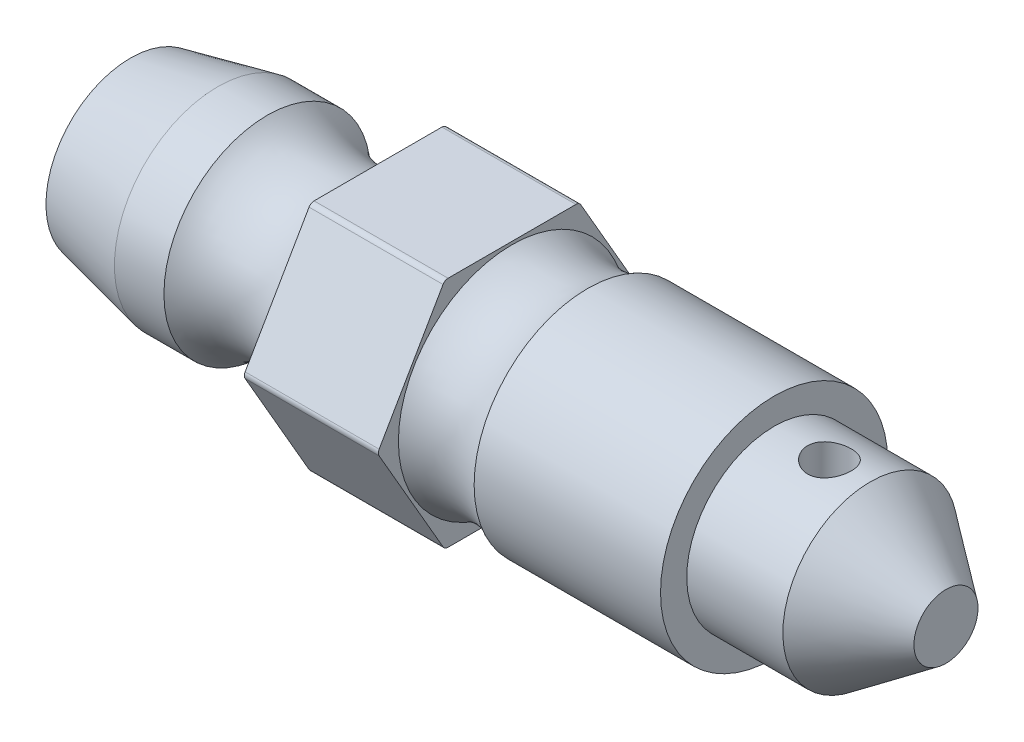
ISO-10303-21;
HEADER;
FILE_DESCRIPTION(('STEP AP214'),'2;1');
FILE_NAME('part.step','',(''),(''),'','','');
FILE_SCHEMA(('AUTOMOTIVE_DESIGN { 1 0 10303 214 1 1 1 1 }'));
ENDSEC;
DATA;
#1=APPLICATION_CONTEXT('core data for automotive mechanical design processes');
#2=APPLICATION_PROTOCOL_DEFINITION('international standard','automotive_design',2000,#1);
#3=PRODUCT_CONTEXT('',#1,'mechanical');
#4=PRODUCT('Part','Part','',(#3));
#5=PRODUCT_RELATED_PRODUCT_CATEGORY('part','',(#4));
#6=PRODUCT_DEFINITION_FORMATION('','',#4);
#7=PRODUCT_DEFINITION_CONTEXT('part definition',#1,'design');
#8=PRODUCT_DEFINITION('design','',#6,#7);
#9=PRODUCT_DEFINITION_SHAPE('','',#8);
#10=(LENGTH_UNIT() NAMED_UNIT(*) SI_UNIT(.MILLI.,.METRE.));
#11=(NAMED_UNIT(*) PLANE_ANGLE_UNIT() SI_UNIT($,.RADIAN.));
#12=(NAMED_UNIT(*) SI_UNIT($,.STERADIAN.) SOLID_ANGLE_UNIT());
#13=UNCERTAINTY_MEASURE_WITH_UNIT(LENGTH_MEASURE(1.E-05),#10,'distance_accuracy_value','');
#14=(GEOMETRIC_REPRESENTATION_CONTEXT(3) GLOBAL_UNCERTAINTY_ASSIGNED_CONTEXT((#13)) GLOBAL_UNIT_ASSIGNED_CONTEXT((#10,
#11,#12)) REPRESENTATION_CONTEXT('',''));
#15=CARTESIAN_POINT('',(0.,0.,0.));
#16=DIRECTION('',(0.,0.,1.));
#17=DIRECTION('',(1.,0.,0.));
#18=AXIS2_PLACEMENT_3D('',#15,#16,#17);
#19=CARTESIAN_POINT('',(8.5,3.55,0.));
#20=DIRECTION('',(-1.,0.,0.));
#21=DIRECTION('',(0.,-1.,0.));
#22=AXIS2_PLACEMENT_3D('',#19,#20,#21);
#23=PLANE('',#22);
#24=CARTESIAN_POINT('',(8.5,0.,0.));
#25=DIRECTION('',(-1.,0.,0.));
#26=DIRECTION('',(0.,0.,1.));
#27=AXIS2_PLACEMENT_3D('',#24,#25,#26);
#28=CIRCLE('',#27,3.55);
#29=CARTESIAN_POINT('',(8.5,0.,3.55));
#30=VERTEX_POINT('',#29);
#31=EDGE_CURVE('E142',#30,#30,#28,.T.);
#32=ORIENTED_EDGE('',*,*,#31,.F.);
#33=EDGE_LOOP('',(#32));
#34=FACE_BOUND('',#33,.T.);
#35=DIRECTION('',(0.,0.866025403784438,-0.5));
#36=VECTOR('',#35,1.);
#37=CARTESIAN_POINT('',(8.5,0.,4.61880215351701));
#38=LINE('',#37,#36);
#39=CARTESIAN_POINT('',(8.5,0.0999999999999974,4.56106712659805));
#40=VERTEX_POINT('',#39);
#41=CARTESIAN_POINT('',(8.5,3.9,2.36713610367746));
#42=VERTEX_POINT('',#41);
#43=EDGE_CURVE('E344',#40,#42,#38,.T.);
#44=ORIENTED_EDGE('',*,*,#43,.T.);
#45=CARTESIAN_POINT('',(8.5,3.8,2.19393102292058));
#46=DIRECTION('',(-1.,0.,0.));
#47=DIRECTION('',(0.,-1.,0.));
#48=AXIS2_PLACEMENT_3D('',#45,#46,#47);
#49=CIRCLE('',#48,0.2);
#50=CARTESIAN_POINT('',(8.5,4.,2.19393102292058));
#51=VERTEX_POINT('',#50);
#52=EDGE_CURVE('E384',#42,#51,#49,.T.);
#53=ORIENTED_EDGE('',*,*,#52,.T.);
#54=DIRECTION('',(0.,0.,-1.));
#55=VECTOR('',#54,1.);
#56=CARTESIAN_POINT('',(8.5,4.,2.3094010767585));
#57=LINE('',#56,#55);
#58=CARTESIAN_POINT('',(8.5,4.,-2.19393102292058));
#59=VERTEX_POINT('',#58);
#60=EDGE_CURVE('E339',#51,#59,#57,.T.);
#61=ORIENTED_EDGE('',*,*,#60,.T.);
#62=CARTESIAN_POINT('',(8.5,3.8,-2.19393102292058));
#63=DIRECTION('',(-1.,0.,0.));
#64=DIRECTION('',(0.,-1.,0.));
#65=AXIS2_PLACEMENT_3D('',#62,#63,#64);
#66=CIRCLE('',#65,0.2);
#67=CARTESIAN_POINT('',(8.5,3.9,-2.36713610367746));
#68=VERTEX_POINT('',#67);
#69=EDGE_CURVE('E378',#59,#68,#66,.T.);
#70=ORIENTED_EDGE('',*,*,#69,.T.);
#71=DIRECTION('',(0.,-0.866025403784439,-0.5));
#72=VECTOR('',#71,1.);
#73=CARTESIAN_POINT('',(8.5,4.,-2.3094010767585));
#74=LINE('',#73,#72);
#75=CARTESIAN_POINT('',(8.5,0.0999999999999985,-4.56106712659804));
#76=VERTEX_POINT('',#75);
#77=EDGE_CURVE('E338',#68,#76,#74,.T.);
#78=ORIENTED_EDGE('',*,*,#77,.T.);
#79=CARTESIAN_POINT('',(8.5,0.,-4.38786204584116));
#80=DIRECTION('',(-1.,0.,0.));
#81=DIRECTION('',(0.,-1.,0.));
#82=AXIS2_PLACEMENT_3D('',#79,#80,#81);
#83=CIRCLE('',#82,0.2);
#84=CARTESIAN_POINT('',(8.5,-0.0999999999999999,-4.56106712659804));
#85=VERTEX_POINT('',#84);
#86=EDGE_CURVE('E337',#76,#85,#83,.T.);
#87=ORIENTED_EDGE('',*,*,#86,.T.);
#88=DIRECTION('',(0.,-0.866025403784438,0.5));
#89=VECTOR('',#88,1.);
#90=CARTESIAN_POINT('',(8.5,0.,-4.61880215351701));
#91=LINE('',#90,#89);
#92=CARTESIAN_POINT('',(8.5,-3.9,-2.36713610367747));
#93=VERTEX_POINT('',#92);
#94=EDGE_CURVE('E329',#85,#93,#91,.T.);
#95=ORIENTED_EDGE('',*,*,#94,.T.);
#96=CARTESIAN_POINT('',(8.5,-3.8,-2.19393102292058));
#97=DIRECTION('',(-1.,0.,0.));
#98=DIRECTION('',(0.,-1.,0.));
#99=AXIS2_PLACEMENT_3D('',#96,#97,#98);
#100=CIRCLE('',#99,0.2);
#101=CARTESIAN_POINT('',(8.5,-4.,-2.19393102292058));
#102=VERTEX_POINT('',#101);
#103=EDGE_CURVE('E334',#93,#102,#100,.T.);
#104=ORIENTED_EDGE('',*,*,#103,.T.);
#105=DIRECTION('',(0.,0.,1.));
#106=VECTOR('',#105,1.);
#107=CARTESIAN_POINT('',(8.5,-4.,-2.3094010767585));
#108=LINE('',#107,#106);
#109=CARTESIAN_POINT('',(8.5,-4.,2.19393102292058));
#110=VERTEX_POINT('',#109);
#111=EDGE_CURVE('E185',#102,#110,#108,.T.);
#112=ORIENTED_EDGE('',*,*,#111,.T.);
#113=CARTESIAN_POINT('',(8.5,-3.8,2.19393102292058));
#114=DIRECTION('',(-1.,0.,0.));
#115=DIRECTION('',(0.,-1.,0.));
#116=AXIS2_PLACEMENT_3D('',#113,#114,#115);
#117=CIRCLE('',#116,0.2);
#118=CARTESIAN_POINT('',(8.5,-3.9,2.36713610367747));
#119=VERTEX_POINT('',#118);
#120=EDGE_CURVE('E351',#110,#119,#117,.T.);
#121=ORIENTED_EDGE('',*,*,#120,.T.);
#122=DIRECTION('',(0.,0.866025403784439,0.5));
#123=VECTOR('',#122,1.);
#124=CARTESIAN_POINT('',(8.5,-4.,2.30940107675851));
#125=LINE('',#124,#123);
#126=CARTESIAN_POINT('',(8.5,-0.100000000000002,4.56106712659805));
#127=VERTEX_POINT('',#126);
#128=EDGE_CURVE('E346',#119,#127,#125,.T.);
#129=ORIENTED_EDGE('',*,*,#128,.T.);
#130=CARTESIAN_POINT('',(8.5,0.,4.38786204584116));
#131=DIRECTION('',(-1.,0.,0.));
#132=DIRECTION('',(0.,-1.,0.));
#133=AXIS2_PLACEMENT_3D('',#130,#131,#132);
#134=CIRCLE('',#133,0.2);
#135=EDGE_CURVE('E349',#127,#40,#134,.T.);
#136=ORIENTED_EDGE('',*,*,#135,.T.);
#137=EDGE_LOOP('',(#44,#53,#61,#70,#78,#87,#95,#104,#112,#121,#129,#136));
#138=FACE_BOUND('',#137,.T.);
#139=ADVANCED_FACE('F37',(#34,#138),#23,.T.);
#140=CARTESIAN_POINT('',(13.1,6.5,0.));
#141=DIRECTION('',(1.,0.,0.));
#142=DIRECTION('',(0.,1.,0.));
#143=AXIS2_PLACEMENT_3D('',#140,#141,#142);
#144=PLANE('',#143);
#145=CARTESIAN_POINT('',(13.1,0.,0.));
#146=DIRECTION('',(-1.,0.,0.));
#147=DIRECTION('',(0.,0.,1.));
#148=AXIS2_PLACEMENT_3D('',#145,#146,#147);
#149=CIRCLE('',#148,3.9);
#150=CARTESIAN_POINT('',(13.1,0.,3.9));
#151=VERTEX_POINT('',#150);
#152=EDGE_CURVE('E149',#151,#151,#149,.T.);
#153=ORIENTED_EDGE('',*,*,#152,.T.);
#154=EDGE_LOOP('',(#153));
#155=FACE_BOUND('',#154,.T.);
#156=DIRECTION('',(0.,0.,1.));
#157=VECTOR('',#156,1.);
#158=CARTESIAN_POINT('',(13.1,4.,0.));
#159=LINE('',#158,#157);
#160=CARTESIAN_POINT('',(13.1,4.,-2.19393102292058));
#161=VERTEX_POINT('',#160);
#162=CARTESIAN_POINT('',(13.1,4.,2.19393102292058));
#163=VERTEX_POINT('',#162);
#164=EDGE_CURVE('E393',#161,#163,#159,.T.);
#165=ORIENTED_EDGE('',*,*,#164,.T.);
#166=CARTESIAN_POINT('',(13.1,3.8,2.19393102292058));
#167=DIRECTION('',(1.,0.,0.));
#168=DIRECTION('',(0.,1.,0.));
#169=AXIS2_PLACEMENT_3D('',#166,#167,#168);
#170=CIRCLE('',#169,0.2);
#171=CARTESIAN_POINT('',(13.1,3.9,2.36713610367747));
#172=VERTEX_POINT('',#171);
#173=EDGE_CURVE('E308',#163,#172,#170,.T.);
#174=ORIENTED_EDGE('',*,*,#173,.T.);
#175=DIRECTION('',(0.,-0.866025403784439,0.5));
#176=VECTOR('',#175,1.);
#177=CARTESIAN_POINT('',(13.1,6.875,0.649519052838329));
#178=LINE('',#177,#176);
#179=CARTESIAN_POINT('',(13.1,0.0999999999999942,4.56106712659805));
#180=VERTEX_POINT('',#179);
#181=EDGE_CURVE('E399',#172,#180,#178,.T.);
#182=ORIENTED_EDGE('',*,*,#181,.T.);
#183=CARTESIAN_POINT('',(13.1,0.,4.38786204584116));
#184=DIRECTION('',(1.,0.,0.));
#185=DIRECTION('',(0.,1.,0.));
#186=AXIS2_PLACEMENT_3D('',#183,#184,#185);
#187=CIRCLE('',#186,0.2);
#188=CARTESIAN_POINT('',(13.1,-0.100000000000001,4.56106712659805));
#189=VERTEX_POINT('',#188);
#190=EDGE_CURVE('E306',#180,#189,#187,.T.);
#191=ORIENTED_EDGE('',*,*,#190,.T.);
#192=DIRECTION('',(0.,-0.866025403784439,-0.5));
#193=VECTOR('',#192,1.);
#194=CARTESIAN_POINT('',(13.1,2.875,6.27868417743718));
#195=LINE('',#194,#193);
#196=CARTESIAN_POINT('',(13.1,-3.9,2.36713610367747));
#197=VERTEX_POINT('',#196);
#198=EDGE_CURVE('E363',#189,#197,#195,.T.);
#199=ORIENTED_EDGE('',*,*,#198,.T.);
#200=CARTESIAN_POINT('',(13.1,-3.8,2.19393102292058));
#201=DIRECTION('',(1.,0.,0.));
#202=DIRECTION('',(0.,1.,0.));
#203=AXIS2_PLACEMENT_3D('',#200,#201,#202);
#204=CIRCLE('',#203,0.2);
#205=CARTESIAN_POINT('',(13.1,-4.,2.19393102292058));
#206=VERTEX_POINT('',#205);
#207=EDGE_CURVE('E299',#197,#206,#204,.T.);
#208=ORIENTED_EDGE('',*,*,#207,.T.);
#209=DIRECTION('',(0.,0.,-1.));
#210=VECTOR('',#209,1.);
#211=CARTESIAN_POINT('',(13.1,-4.,0.));
#212=LINE('',#211,#210);
#213=CARTESIAN_POINT('',(13.1,-4.,-2.19393102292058));
#214=VERTEX_POINT('',#213);
#215=EDGE_CURVE('E362',#206,#214,#212,.T.);
#216=ORIENTED_EDGE('',*,*,#215,.T.);
#217=CARTESIAN_POINT('',(13.1,-3.8,-2.19393102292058));
#218=DIRECTION('',(1.,0.,0.));
#219=DIRECTION('',(0.,1.,0.));
#220=AXIS2_PLACEMENT_3D('',#217,#218,#219);
#221=CIRCLE('',#220,0.2);
#222=CARTESIAN_POINT('',(13.1,-3.9,-2.36713610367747));
#223=VERTEX_POINT('',#222);
#224=EDGE_CURVE('E296',#214,#223,#221,.T.);
#225=ORIENTED_EDGE('',*,*,#224,.T.);
#226=DIRECTION('',(0.,0.866025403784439,-0.5));
#227=VECTOR('',#226,1.);
#228=CARTESIAN_POINT('',(13.1,2.875,-6.27868417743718));
#229=LINE('',#228,#227);
#230=CARTESIAN_POINT('',(13.1,-0.1,-4.56106712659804));
#231=VERTEX_POINT('',#230);
#232=EDGE_CURVE('E330',#223,#231,#229,.T.);
#233=ORIENTED_EDGE('',*,*,#232,.T.);
#234=CARTESIAN_POINT('',(13.1,0.,-4.38786204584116));
#235=DIRECTION('',(1.,0.,0.));
#236=DIRECTION('',(0.,1.,0.));
#237=AXIS2_PLACEMENT_3D('',#234,#235,#236);
#238=CIRCLE('',#237,0.2);
#239=CARTESIAN_POINT('',(13.1,0.0999999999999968,-4.56106712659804));
#240=VERTEX_POINT('',#239);
#241=EDGE_CURVE('E58',#231,#240,#238,.T.);
#242=ORIENTED_EDGE('',*,*,#241,.T.);
#243=DIRECTION('',(0.,0.866025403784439,0.5));
#244=VECTOR('',#243,1.);
#245=CARTESIAN_POINT('',(13.1,6.875,-0.64951905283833));
#246=LINE('',#245,#244);
#247=CARTESIAN_POINT('',(13.1,3.9,-2.36713610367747));
#248=VERTEX_POINT('',#247);
#249=EDGE_CURVE('E370',#240,#248,#246,.T.);
#250=ORIENTED_EDGE('',*,*,#249,.T.);
#251=CARTESIAN_POINT('',(13.1,3.8,-2.19393102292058));
#252=DIRECTION('',(1.,0.,0.));
#253=DIRECTION('',(0.,1.,0.));
#254=AXIS2_PLACEMENT_3D('',#251,#252,#253);
#255=CIRCLE('',#254,0.2);
#256=EDGE_CURVE('E297',#248,#161,#255,.T.);
#257=ORIENTED_EDGE('',*,*,#256,.T.);
#258=EDGE_LOOP('',(#165,#174,#182,#191,#199,#208,#216,#225,#233,#242,#250,#257));
#259=FACE_BOUND('',#258,.T.);
#260=ADVANCED_FACE('F257',(#155,#259),#144,.T.);
#261=CARTESIAN_POINT('',(28.,0.,0.));
#262=DIRECTION('',(1.,0.,0.));
#263=DIRECTION('',(0.,1.,0.));
#264=AXIS2_PLACEMENT_3D('',#261,#262,#263);
#265=CYLINDRICAL_SURFACE('',#264,3.9);
#266=CARTESIAN_POINT('',(22.1,0.,0.));
#267=DIRECTION('',(1.,0.,0.));
#268=DIRECTION('',(0.,1.,0.));
#269=AXIS2_PLACEMENT_3D('',#266,#267,#268);
#270=CIRCLE('',#269,3.9);
#271=CARTESIAN_POINT('',(22.1,3.9,0.));
#272=VERTEX_POINT('',#271);
#273=EDGE_CURVE('E166',#272,#272,#270,.T.);
#274=ORIENTED_EDGE('',*,*,#273,.F.);
#275=EDGE_LOOP('',(#274));
#276=FACE_BOUND('',#275,.T.);
#277=CARTESIAN_POINT('',(15.7,0.,0.));
#278=DIRECTION('',(-1.,0.,0.));
#279=DIRECTION('',(0.,0.,1.));
#280=AXIS2_PLACEMENT_3D('',#277,#278,#279);
#281=CIRCLE('',#280,3.9);
#282=CARTESIAN_POINT('',(15.7,0.,3.9));
#283=VERTEX_POINT('',#282);
#284=EDGE_CURVE('E152',#283,#283,#281,.T.);
#285=ORIENTED_EDGE('',*,*,#284,.F.);
#286=EDGE_LOOP('',(#285));
#287=FACE_BOUND('',#286,.T.);
#288=ADVANCED_FACE('F263',(#276,#287),#265,.T.);
#289=CARTESIAN_POINT('',(22.1,3.9,0.));
#290=DIRECTION('',(1.,0.,0.));
#291=DIRECTION('',(0.,1.,0.));
#292=AXIS2_PLACEMENT_3D('',#289,#290,#291);
#293=PLANE('',#292);
#294=ORIENTED_EDGE('',*,*,#273,.T.);
#295=EDGE_LOOP('',(#294));
#296=FACE_BOUND('',#295,.T.);
#297=CARTESIAN_POINT('',(22.1,0.,0.));
#298=DIRECTION('',(1.,0.,0.));
#299=DIRECTION('',(0.,1.,0.));
#300=AXIS2_PLACEMENT_3D('',#297,#298,#299);
#301=CIRCLE('',#300,3.);
#302=CARTESIAN_POINT('',(22.1,3.,0.));
#303=VERTEX_POINT('',#302);
#304=EDGE_CURVE('E163',#303,#303,#301,.T.);
#305=ORIENTED_EDGE('',*,*,#304,.F.);
#306=EDGE_LOOP('',(#305));
#307=FACE_BOUND('',#306,.T.);
#308=ADVANCED_FACE('F414',(#296,#307),#293,.T.);
#309=CARTESIAN_POINT('',(28.,0.,0.));
#310=DIRECTION('',(1.,0.,0.));
#311=DIRECTION('',(0.,1.,0.));
#312=AXIS2_PLACEMENT_3D('',#309,#310,#311);
#313=CYLINDRICAL_SURFACE('',#312,3.);
#314=CARTESIAN_POINT('',(23.25,3.,0.));
#315=CARTESIAN_POINT('',(23.2500011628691,2.99999929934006,0.0414380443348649));
#316=CARTESIAN_POINT('',(23.2534457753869,2.99913289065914,0.0828890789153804));
#317=CARTESIAN_POINT('',(23.2671125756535,2.99576056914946,0.164603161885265));
#318=CARTESIAN_POINT('',(23.2773386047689,2.99325372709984,0.204865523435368));
#319=CARTESIAN_POINT('',(23.3042196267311,2.9868781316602,0.283010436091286));
#320=CARTESIAN_POINT('',(23.3208668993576,2.98301101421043,0.320895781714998));
#321=CARTESIAN_POINT('',(23.3600906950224,2.97432671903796,0.393336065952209));
#322=CARTESIAN_POINT('',(23.3826674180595,2.96950950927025,0.427890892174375));
#323=CARTESIAN_POINT('',(23.4336003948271,2.95933706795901,0.493400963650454));
#324=CARTESIAN_POINT('',(23.4620557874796,2.95397353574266,0.524277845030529));
#325=CARTESIAN_POINT('',(23.5237261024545,2.94336810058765,0.580874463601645));
#326=CARTESIAN_POINT('',(23.5569415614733,2.93812621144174,0.606593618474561));
#327=CARTESIAN_POINT('',(23.6277976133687,2.92827387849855,0.65251327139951));
#328=CARTESIAN_POINT('',(23.6654966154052,2.92367397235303,0.672626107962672));
#329=CARTESIAN_POINT('',(23.7438742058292,2.91574747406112,0.706198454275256));
#330=CARTESIAN_POINT('',(23.7845523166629,2.91242067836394,0.719659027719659));
#331=CARTESIAN_POINT('',(23.8668717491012,2.90750238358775,0.739277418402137));
#332=CARTESIAN_POINT('',(23.9084774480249,2.90587745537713,0.745576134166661));
#333=CARTESIAN_POINT('',(23.992184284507,2.90444681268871,0.751130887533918));
#334=CARTESIAN_POINT('',(24.0342853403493,2.90464080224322,0.750388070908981));
#335=CARTESIAN_POINT('',(24.1167079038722,2.90679602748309,0.741993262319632));
#336=CARTESIAN_POINT('',(24.1570478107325,2.9087143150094,0.734509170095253));
#337=CARTESIAN_POINT('',(24.2358805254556,2.91403354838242,0.713112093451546));
#338=CARTESIAN_POINT('',(24.2743732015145,2.91743459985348,0.699198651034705));
#339=CARTESIAN_POINT('',(24.348869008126,2.92537556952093,0.665194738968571));
#340=CARTESIAN_POINT('',(24.3848430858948,2.92992663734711,0.64504333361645));
#341=CARTESIAN_POINT('',(24.4529593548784,2.93964855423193,0.599178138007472));
#342=CARTESIAN_POINT('',(24.4851008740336,2.94481951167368,0.573463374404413));
#343=CARTESIAN_POINT('',(24.5456018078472,2.9553794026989,0.516331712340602));
#344=CARTESIAN_POINT('',(24.5738272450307,2.96077034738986,0.484773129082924));
#345=CARTESIAN_POINT('',(24.6246106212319,2.97102982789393,0.417305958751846));
#346=CARTESIAN_POINT('',(24.6471683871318,2.97589834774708,0.381397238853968));
#347=CARTESIAN_POINT('',(24.6860252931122,2.98458866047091,0.306057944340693));
#348=CARTESIAN_POINT('',(24.7023026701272,2.98840680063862,0.266615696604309));
#349=CARTESIAN_POINT('',(24.7279586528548,2.99453958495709,0.18543800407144));
#350=CARTESIAN_POINT('',(24.7373385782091,2.9968545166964,0.143702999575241));
#351=CARTESIAN_POINT('',(24.7487287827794,2.99967749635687,0.0602699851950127));
#352=CARTESIAN_POINT('',(24.7509215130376,3.00023026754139,0.0185983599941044));
#353=CARTESIAN_POINT('',(24.7483754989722,2.99959402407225,-0.064516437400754));
#354=CARTESIAN_POINT('',(24.7436373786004,2.99840516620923,-0.105959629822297));
#355=CARTESIAN_POINT('',(24.7275145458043,2.99444790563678,-0.186807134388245));
#356=CARTESIAN_POINT('',(24.7162293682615,2.99170317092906,-0.226232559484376));
#357=CARTESIAN_POINT('',(24.6874464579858,2.98494353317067,-0.302628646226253));
#358=CARTESIAN_POINT('',(24.6699480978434,2.98092850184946,-0.339599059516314));
#359=CARTESIAN_POINT('',(24.6288819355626,2.97196653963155,-0.410761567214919));
#360=CARTESIAN_POINT('',(24.6052119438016,2.96700433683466,-0.44489272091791));
#361=CARTESIAN_POINT('',(24.5526050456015,2.9567225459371,-0.508763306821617));
#362=CARTESIAN_POINT('',(24.5236672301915,2.95140289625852,-0.538501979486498));
#363=CARTESIAN_POINT('',(24.4604990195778,2.94084478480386,-0.593495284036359));
#364=CARTESIAN_POINT('',(24.4261561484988,2.93561152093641,-0.61862193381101));
#365=CARTESIAN_POINT('',(24.3536336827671,2.92596439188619,-0.662755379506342));
#366=CARTESIAN_POINT('',(24.3154542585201,2.92155049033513,-0.68176244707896));
#367=CARTESIAN_POINT('',(24.2365471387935,2.91409047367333,-0.712975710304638));
#368=CARTESIAN_POINT('',(24.195836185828,2.91103627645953,-0.725222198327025));
#369=CARTESIAN_POINT('',(24.1128451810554,2.90663372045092,-0.742672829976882));
#370=CARTESIAN_POINT('',(24.0705654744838,2.90528498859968,-0.747878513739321));
#371=CARTESIAN_POINT('',(23.9869394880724,2.90447450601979,-0.751019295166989));
#372=CARTESIAN_POINT('',(23.9456012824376,2.90495966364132,-0.749158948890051));
#373=CARTESIAN_POINT('',(23.863848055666,2.90763954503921,-0.738688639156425));
#374=CARTESIAN_POINT('',(23.8234330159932,2.90983423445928,-0.730078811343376));
#375=CARTESIAN_POINT('',(23.7448957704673,2.91565630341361,-0.706465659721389));
#376=CARTESIAN_POINT('',(23.7067613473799,2.91927507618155,-0.691500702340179));
#377=CARTESIAN_POINT('',(23.6335173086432,2.92753877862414,-0.655632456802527));
#378=CARTESIAN_POINT('',(23.5984081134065,2.93218385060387,-0.634728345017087));
#379=CARTESIAN_POINT('',(23.531222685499,2.94212817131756,-0.586933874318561));
#380=CARTESIAN_POINT('',(23.499249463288,2.94744132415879,-0.559901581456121));
#381=CARTESIAN_POINT('',(23.4402264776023,2.95804013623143,-0.500894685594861));
#382=CARTESIAN_POINT('',(23.4131778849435,2.9633257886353,-0.468918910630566));
#383=CARTESIAN_POINT('',(23.3642943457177,2.97338827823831,-0.400233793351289));
#384=CARTESIAN_POINT('',(23.3425626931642,2.97815416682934,-0.363449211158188));
#385=CARTESIAN_POINT('',(23.3056262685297,2.98652462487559,-0.286633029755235));
#386=CARTESIAN_POINT('',(23.2904168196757,2.99013002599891,-0.246603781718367));
#387=CARTESIAN_POINT('',(23.2692140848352,2.99524029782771,-0.172205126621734));
#388=CARTESIAN_POINT('',(23.2620243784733,2.99701292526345,-0.138190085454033));
#389=CARTESIAN_POINT('',(23.252417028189,2.99939302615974,-0.0694530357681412));
#390=CARTESIAN_POINT('',(23.2499990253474,3.00000058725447,-0.034731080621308));
#391=CARTESIAN_POINT('',(23.25,3.,0.));
#392=B_SPLINE_CURVE_WITH_KNOTS('',3,(#314,#315,#316,#317,#318,#319,#320,#321,#322,#323,#324,
#325,#326,#327,#328,#329,#330,#331,#332,#333,#334,#335,#336,#337,#338,#339,#340,#341,#342,#343,
#344,#345,#346,#347,#348,#349,#350,#351,#352,#353,#354,#355,#356,#357,#358,#359,#360,#361,#362,
#363,#364,#365,#366,#367,#368,#369,#370,#371,#372,#373,#374,#375,#376,#377,#378,#379,#380,#381,
#382,#383,#384,#385,#386,#387,#388,#389,#390,#391),.UNSPECIFIED.,.T.,.F.,(4,2,2,2,2,2,2,2,2,2,2,
2,2,2,2,2,2,2,2,2,2,2,2,2,2,2,2,2,2,2,2,2,2,2,2,2,2,2,4),(0.,0.124186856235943,
0.248444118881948,0.372552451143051,0.496664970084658,0.623072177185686,0.749493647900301,
0.877793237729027,1.00607230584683,1.13178147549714,1.25747019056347,1.38011248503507,
1.50276351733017,1.62665263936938,1.7505634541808,1.87800750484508,2.00545544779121,
2.13334114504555,2.26120236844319,2.38579154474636,2.51036950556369,2.63310137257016,
2.75584563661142,2.88076793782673,3.00571181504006,3.13372254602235,3.2617275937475,
3.38896127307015,3.516167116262,3.63971890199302,3.76326820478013,3.88608200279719,
4.00891284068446,4.13494788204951,4.26101284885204,4.38936092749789,4.5176168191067,
4.62171121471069,4.72579778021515),.UNSPECIFIED.);
#393=CARTESIAN_POINT('',(23.25,3.,0.));
#394=VERTEX_POINT('',#393);
#395=EDGE_CURVE('E175',#394,#394,#392,.T.);
#396=ORIENTED_EDGE('',*,*,#395,.F.);
#397=EDGE_LOOP('',(#396));
#398=FACE_BOUND('',#397,.T.);
#399=CARTESIAN_POINT('',(24.,-2.90473750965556,0.749999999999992));
#400=CARTESIAN_POINT('',(23.9585847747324,-2.90473830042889,0.749998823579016));
#401=CARTESIAN_POINT('',(23.9171565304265,-2.90563291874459,0.746557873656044));
#402=CARTESIAN_POINT('',(23.8354897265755,-2.90910558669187,0.732906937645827));
#403=CARTESIAN_POINT('',(23.795251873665,-2.91168461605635,0.72269301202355));
#404=CARTESIAN_POINT('',(23.7171589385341,-2.91821617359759,0.695847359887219));
#405=CARTESIAN_POINT('',(23.6793008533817,-2.9221669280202,0.679223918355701));
#406=CARTESIAN_POINT('',(23.6069067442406,-2.93099457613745,0.640056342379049));
#407=CARTESIAN_POINT('',(23.5723708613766,-2.93587150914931,0.617511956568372));
#408=CARTESIAN_POINT('',(23.5068415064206,-2.94612214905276,0.566612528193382));
#409=CARTESIAN_POINT('',(23.4759319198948,-2.95150379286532,0.538151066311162));
#410=CARTESIAN_POINT('',(23.4192715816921,-2.96208862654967,0.476454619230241));
#411=CARTESIAN_POINT('',(23.3935213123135,-2.96729179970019,0.4432191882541));
#412=CARTESIAN_POINT('',(23.3475673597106,-2.97702124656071,0.37234356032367));
#413=CARTESIAN_POINT('',(23.3274460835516,-2.9815370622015,0.33464837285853));
#414=CARTESIAN_POINT('',(23.2938571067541,-2.98929243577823,0.256278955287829));
#415=CARTESIAN_POINT('',(23.2803884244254,-2.99253218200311,0.21560516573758));
#416=CARTESIAN_POINT('',(23.2607556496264,-2.99731427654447,0.133307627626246));
#417=CARTESIAN_POINT('',(23.254449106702,-2.99888968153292,0.0917198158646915));
#418=CARTESIAN_POINT('',(23.2488724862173,-3.00028078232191,0.00804864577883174));
#419=CARTESIAN_POINT('',(23.2496013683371,-3.00009673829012,-0.0340346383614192));
#420=CARTESIAN_POINT('',(23.2579724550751,-2.9980142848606,-0.116514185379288));
#421=CARTESIAN_POINT('',(23.2654608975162,-2.99615400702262,-0.156927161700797));
#422=CARTESIAN_POINT('',(23.2868913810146,-2.99097250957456,-0.23590368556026));
#423=CARTESIAN_POINT('',(23.3008337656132,-2.98765121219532,-0.274467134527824));
#424=CARTESIAN_POINT('',(23.3349007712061,-2.97986252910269,-0.34905502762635));
#425=CARTESIAN_POINT('',(23.3550801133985,-2.97538505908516,-0.385053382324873));
#426=CARTESIAN_POINT('',(23.4010067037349,-2.96576971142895,-0.45320671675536));
#427=CARTESIAN_POINT('',(23.4267549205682,-2.96063171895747,-0.485361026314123));
#428=CARTESIAN_POINT('',(23.4839126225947,-2.95009114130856,-0.54583052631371));
#429=CARTESIAN_POINT('',(23.5154564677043,-2.94468515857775,-0.574018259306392));
#430=CARTESIAN_POINT('',(23.5828799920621,-2.93434513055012,-0.624732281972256));
#431=CARTESIAN_POINT('',(23.6187598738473,-2.92941110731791,-0.647258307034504));
#432=CARTESIAN_POINT('',(23.6940870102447,-2.92056149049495,-0.68609109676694));
#433=CARTESIAN_POINT('',(23.733550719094,-2.91665095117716,-0.70236717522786));
#434=CARTESIAN_POINT('',(23.8147756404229,-2.91035592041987,-0.728014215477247));
#435=CARTESIAN_POINT('',(23.8565363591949,-2.90797110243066,-0.737386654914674));
#436=CARTESIAN_POINT('',(23.9399878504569,-2.90506606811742,-0.748748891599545));
#437=CARTESIAN_POINT('',(23.9816513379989,-2.90449826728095,-0.75092714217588));
#438=CARTESIAN_POINT('',(24.0647465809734,-2.90516203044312,-0.748355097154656));
#439=CARTESIAN_POINT('',(24.1061783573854,-2.9063934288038,-0.743605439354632));
#440=CARTESIAN_POINT('',(24.1869342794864,-2.91047124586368,-0.727477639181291));
#441=CARTESIAN_POINT('',(24.2262818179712,-2.91329091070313,-0.716209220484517));
#442=CARTESIAN_POINT('',(24.3025294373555,-2.92020215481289,-0.68748542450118));
#443=CARTESIAN_POINT('',(24.3394292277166,-2.92429388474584,-0.670029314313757));
#444=CARTESIAN_POINT('',(24.4105323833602,-2.93338841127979,-0.62903120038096));
#445=CARTESIAN_POINT('',(24.4446686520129,-2.93840750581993,-0.605376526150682));
#446=CARTESIAN_POINT('',(24.5085565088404,-2.94875124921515,-0.552795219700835));
#447=CARTESIAN_POINT('',(24.538307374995,-2.95407594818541,-0.523867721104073));
#448=CARTESIAN_POINT('',(24.5933433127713,-2.96459220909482,-0.460697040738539));
#449=CARTESIAN_POINT('',(24.6184980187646,-2.96977710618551,-0.426338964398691));
#450=CARTESIAN_POINT('',(24.6626807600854,-2.9792916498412,-0.353777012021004));
#451=CARTESIAN_POINT('',(24.6817091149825,-2.98362134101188,-0.315573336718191));
#452=CARTESIAN_POINT('',(24.7129338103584,-2.99091034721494,-0.236668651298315));
#453=CARTESIAN_POINT('',(24.7251792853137,-2.99387949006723,-0.195988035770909));
#454=CARTESIAN_POINT('',(24.7426381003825,-2.99815588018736,-0.113062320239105));
#455=CARTESIAN_POINT('',(24.7478527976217,-2.99946344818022,-0.0708175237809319));
#456=CARTESIAN_POINT('',(24.7510256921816,-3.00025627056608,0.0128126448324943));
#457=CARTESIAN_POINT('',(24.7491762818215,-2.99978984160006,0.0541903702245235));
#458=CARTESIAN_POINT('',(24.7387141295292,-2.99719422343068,0.136025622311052));
#459=CARTESIAN_POINT('',(24.7301015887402,-2.99506508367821,0.176483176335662));
#460=CARTESIAN_POINT('',(24.7064608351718,-2.98939074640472,0.255128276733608));
#461=CARTESIAN_POINT('',(24.691467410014,-2.98585323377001,0.29332687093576));
#462=CARTESIAN_POINT('',(24.6555220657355,-2.97773466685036,0.366687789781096));
#463=CARTESIAN_POINT('',(24.6345693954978,-2.97315348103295,0.401849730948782));
#464=CARTESIAN_POINT('',(24.5867135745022,-2.96330437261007,0.469051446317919));
#465=CARTESIAN_POINT('',(24.5596798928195,-2.95802262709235,0.500996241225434));
#466=CARTESIAN_POINT('',(24.5006828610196,-2.94742986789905,0.559961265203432));
#467=CARTESIAN_POINT('',(24.4687182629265,-2.94211884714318,0.586980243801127));
#468=CARTESIAN_POINT('',(24.400048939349,-2.93195606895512,0.635821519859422));
#469=CARTESIAN_POINT('',(24.3632669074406,-2.92711472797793,0.657537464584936));
#470=CARTESIAN_POINT('',(24.2864583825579,-2.91857966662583,0.694445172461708));
#471=CARTESIAN_POINT('',(24.2464342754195,-2.91488511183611,0.709641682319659));
#472=CARTESIAN_POINT('',(24.1720672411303,-2.90963931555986,0.73081689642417));
#473=CARTESIAN_POINT('',(24.1380801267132,-2.90781497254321,0.737994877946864));
#474=CARTESIAN_POINT('',(24.0693983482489,-2.90536378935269,0.747586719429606));
#475=CARTESIAN_POINT('',(24.034703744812,-2.90473684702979,0.750000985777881));
#476=CARTESIAN_POINT('',(24.,-2.90473750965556,0.749999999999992));
#477=B_SPLINE_CURVE_WITH_KNOTS('',3,(#399,#400,#401,#402,#403,#404,#405,#406,#407,#408,#409,
#410,#411,#412,#413,#414,#415,#416,#417,#418,#419,#420,#421,#422,#423,#424,#425,#426,#427,#428,
#429,#430,#431,#432,#433,#434,#435,#436,#437,#438,#439,#440,#441,#442,#443,#444,#445,#446,#447,
#448,#449,#450,#451,#452,#453,#454,#455,#456,#457,#458,#459,#460,#461,#462,#463,#464,#465,#466,
#467,#468,#469,#470,#471,#472,#473,#474,#475,#476),.UNSPECIFIED.,.T.,.F.,(4,2,2,2,2,2,2,2,2,2,2,
2,2,2,2,2,2,2,2,2,2,2,2,2,2,2,2,2,2,2,2,2,2,2,2,2,2,2,4),(0.,0.124118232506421,
0.248308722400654,0.372339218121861,0.49637498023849,0.62287186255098,0.74938056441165,
0.87765448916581,1.00590947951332,1.13156625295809,1.25720444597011,1.38005478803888,
1.5029116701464,1.62687862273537,1.75086715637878,1.87821139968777,2.00556159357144,
2.13352929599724,2.26146960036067,2.38603072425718,2.51058038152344,2.63309221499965,
2.75561856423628,2.8805485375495,3.00549905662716,3.13357599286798,3.26164624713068,
3.38877621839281,3.51588164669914,3.63955033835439,3.76321535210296,3.88621462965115,
4.00922941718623,4.13519128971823,4.26118509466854,4.38952943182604,4.51778016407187,
4.621793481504,4.72579792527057),.UNSPECIFIED.);
#478=CARTESIAN_POINT('',(24.,-2.90473750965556,0.749999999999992));
#479=VERTEX_POINT('',#478);
#480=EDGE_CURVE('E176',#479,#479,#477,.T.);
#481=ORIENTED_EDGE('',*,*,#480,.F.);
#482=EDGE_LOOP('',(#481));
#483=FACE_BOUND('',#482,.T.);
#484=ORIENTED_EDGE('',*,*,#304,.T.);
#485=EDGE_LOOP('',(#484));
#486=FACE_BOUND('',#485,.T.);
#487=CARTESIAN_POINT('',(25.4,0.,0.));
#488=DIRECTION('',(1.,0.,0.));
#489=DIRECTION('',(0.,1.,0.));
#490=AXIS2_PLACEMENT_3D('',#487,#488,#489);
#491=CIRCLE('',#490,3.);
#492=CARTESIAN_POINT('',(25.4,3.,0.));
#493=VERTEX_POINT('',#492);
#494=EDGE_CURVE('E160',#493,#493,#491,.T.);
#495=ORIENTED_EDGE('',*,*,#494,.F.);
#496=EDGE_LOOP('',(#495));
#497=FACE_BOUND('',#496,.T.);
#498=ADVANCED_FACE('F190',(#398,#483,#486,#497),#313,.T.);
#499=CARTESIAN_POINT('',(28.,0.,0.));
#500=DIRECTION('',(-1.,0.,0.));
#501=DIRECTION('',(0.,-1.,0.));
#502=AXIS2_PLACEMENT_3D('',#499,#500,#501);
#503=CONICAL_SURFACE('',#502,1.1,0.631079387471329);
#504=ORIENTED_EDGE('',*,*,#494,.T.);
#505=EDGE_LOOP('',(#504));
#506=FACE_BOUND('',#505,.T.);
#507=CARTESIAN_POINT('',(28.,0.,0.));
#508=DIRECTION('',(1.,0.,0.));
#509=DIRECTION('',(0.,1.,0.));
#510=AXIS2_PLACEMENT_3D('',#507,#508,#509);
#511=CIRCLE('',#510,1.1);
#512=CARTESIAN_POINT('',(28.,1.1,0.));
#513=VERTEX_POINT('',#512);
#514=EDGE_CURVE('E154',#513,#513,#511,.T.);
#515=ORIENTED_EDGE('',*,*,#514,.F.);
#516=EDGE_LOOP('',(#515));
#517=FACE_BOUND('',#516,.T.);
#518=ADVANCED_FACE('F413',(#506,#517),#503,.T.);
#519=CARTESIAN_POINT('',(28.,1.1,0.));
#520=DIRECTION('',(1.,0.,0.));
#521=DIRECTION('',(0.,1.,0.));
#522=AXIS2_PLACEMENT_3D('',#519,#520,#521);
#523=PLANE('',#522);
#524=ORIENTED_EDGE('',*,*,#514,.T.);
#525=EDGE_LOOP('',(#524));
#526=FACE_BOUND('',#525,.T.);
#527=ADVANCED_FACE('F252',(#526),#523,.T.);
#528=CARTESIAN_POINT('',(14.4,0.,0.));
#529=DIRECTION('',(-1.,0.,0.));
#530=DIRECTION('',(0.,0.,1.));
#531=AXIS2_PLACEMENT_3D('',#528,#529,#530);
#532=TOROIDAL_SURFACE('',#531,6.13928571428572,2.58928571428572);
#533=ORIENTED_EDGE('',*,*,#284,.T.);
#534=EDGE_LOOP('',(#533));
#535=FACE_BOUND('',#534,.T.);
#536=ORIENTED_EDGE('',*,*,#152,.F.);
#537=EDGE_LOOP('',(#536));
#538=FACE_BOUND('',#537,.T.);
#539=ADVANCED_FACE('F246',(#535,#538),#532,.F.);
#540=CARTESIAN_POINT('',(6.6,0.,0.));
#541=DIRECTION('',(-1.,0.,0.));
#542=DIRECTION('',(0.,0.,1.));
#543=AXIS2_PLACEMENT_3D('',#540,#541,#542);
#544=TOROIDAL_SURFACE('',#543,5.58166666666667,2.78166666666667);
#545=ORIENTED_EDGE('',*,*,#31,.T.);
#546=EDGE_LOOP('',(#545));
#547=FACE_BOUND('',#546,.T.);
#548=CARTESIAN_POINT('',(4.7,0.,0.));
#549=DIRECTION('',(-1.,0.,0.));
#550=DIRECTION('',(0.,0.,1.));
#551=AXIS2_PLACEMENT_3D('',#548,#549,#550);
#552=CIRCLE('',#551,3.55);
#553=CARTESIAN_POINT('',(4.7,0.,3.55));
#554=VERTEX_POINT('',#553);
#555=EDGE_CURVE('E138',#554,#554,#552,.T.);
#556=ORIENTED_EDGE('',*,*,#555,.F.);
#557=EDGE_LOOP('',(#556));
#558=FACE_BOUND('',#557,.T.);
#559=ADVANCED_FACE('F231',(#547,#558),#544,.F.);
#560=CARTESIAN_POINT('',(0.,0.,0.));
#561=DIRECTION('',(-1.,0.,0.));
#562=DIRECTION('',(0.,-1.,0.));
#563=AXIS2_PLACEMENT_3D('',#560,#561,#562);
#564=PLANE('',#563);
#565=CARTESIAN_POINT('',(0.,0.,0.));
#566=DIRECTION('',(-1.,0.,0.));
#567=DIRECTION('',(0.,0.,1.));
#568=AXIS2_PLACEMENT_3D('',#565,#566,#567);
#569=CIRCLE('',#568,1.49999999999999);
#570=CARTESIAN_POINT('',(0.,0.,1.49999999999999));
#571=VERTEX_POINT('',#570);
#572=EDGE_CURVE('E139',#571,#571,#569,.T.);
#573=ORIENTED_EDGE('',*,*,#572,.F.);
#574=EDGE_LOOP('',(#573));
#575=FACE_BOUND('',#574,.T.);
#576=CARTESIAN_POINT('',(0.,0.,0.));
#577=DIRECTION('',(1.,0.,0.));
#578=DIRECTION('',(0.,1.,0.));
#579=AXIS2_PLACEMENT_3D('',#576,#577,#578);
#580=CIRCLE('',#579,2.9);
#581=CARTESIAN_POINT('',(0.,2.9,0.));
#582=VERTEX_POINT('',#581);
#583=EDGE_CURVE('E172',#582,#582,#580,.T.);
#584=ORIENTED_EDGE('',*,*,#583,.F.);
#585=EDGE_LOOP('',(#584));
#586=FACE_BOUND('',#585,.T.);
#587=ADVANCED_FACE('F227',(#575,#586),#564,.T.);
#588=CARTESIAN_POINT('',(3.,0.,0.));
#589=DIRECTION('',(1.,0.,0.));
#590=DIRECTION('',(0.,1.,0.));
#591=AXIS2_PLACEMENT_3D('',#588,#589,#590);
#592=CONICAL_SURFACE('',#591,3.55,0.213368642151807);
#593=ORIENTED_EDGE('',*,*,#583,.T.);
#594=EDGE_LOOP('',(#593));
#595=FACE_BOUND('',#594,.T.);
#596=CARTESIAN_POINT('',(3.,0.,0.));
#597=DIRECTION('',(1.,0.,0.));
#598=DIRECTION('',(0.,1.,0.));
#599=AXIS2_PLACEMENT_3D('',#596,#597,#598);
#600=CIRCLE('',#599,3.55);
#601=CARTESIAN_POINT('',(3.,3.55,0.));
#602=VERTEX_POINT('',#601);
#603=EDGE_CURVE('E169',#602,#602,#600,.T.);
#604=ORIENTED_EDGE('',*,*,#603,.F.);
#605=EDGE_LOOP('',(#604));
#606=FACE_BOUND('',#605,.T.);
#607=ADVANCED_FACE('F230',(#595,#606),#592,.T.);
#608=CARTESIAN_POINT('',(28.,0.,0.));
#609=DIRECTION('',(1.,0.,0.));
#610=DIRECTION('',(0.,1.,0.));
#611=AXIS2_PLACEMENT_3D('',#608,#609,#610);
#612=CYLINDRICAL_SURFACE('',#611,3.55);
#613=ORIENTED_EDGE('',*,*,#603,.T.);
#614=EDGE_LOOP('',(#613));
#615=FACE_BOUND('',#614,.T.);
#616=ORIENTED_EDGE('',*,*,#555,.T.);
#617=EDGE_LOOP('',(#616));
#618=FACE_BOUND('',#617,.T.);
#619=ADVANCED_FACE('F132',(#615,#618),#612,.T.);
#620=CARTESIAN_POINT('',(26.5,0.,0.));
#621=DIRECTION('',(-1.,0.,0.));
#622=DIRECTION('',(0.,0.,1.));
#623=AXIS2_PLACEMENT_3D('',#620,#621,#622);
#624=CONICAL_SURFACE('',#623,1.49999999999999,1.02974425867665);
#625=CARTESIAN_POINT('',(27.4012909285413,0.,0.));
#626=VERTEX_POINT('',#625);
#627=VERTEX_LOOP('',#626);
#628=FACE_BOUND('',#627,.T.);
#629=CARTESIAN_POINT('',(26.5,0.,0.));
#630=DIRECTION('',(-1.,0.,0.));
#631=DIRECTION('',(0.,0.,1.));
#632=AXIS2_PLACEMENT_3D('',#629,#630,#631);
#633=CIRCLE('',#632,1.49999999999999);
#634=CARTESIAN_POINT('',(26.5,0.,1.49999999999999));
#635=VERTEX_POINT('',#634);
#636=EDGE_CURVE('E136',#635,#635,#633,.T.);
#637=ORIENTED_EDGE('',*,*,#636,.T.);
#638=EDGE_LOOP('',(#637));
#639=FACE_BOUND('',#638,.T.);
#640=ADVANCED_FACE('F128',(#628,#639),#624,.F.);
#641=CARTESIAN_POINT('',(0.,0.,0.));
#642=DIRECTION('',(-1.,0.,0.));
#643=DIRECTION('',(0.,0.,1.));
#644=AXIS2_PLACEMENT_3D('',#641,#642,#643);
#645=CYLINDRICAL_SURFACE('',#644,1.49999999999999);
#646=CARTESIAN_POINT('',(24.,-1.29903810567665,0.749999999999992));
#647=CARTESIAN_POINT('',(23.9609191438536,-1.29904151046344,0.749997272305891));
#648=CARTESIAN_POINT('',(23.9217889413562,-1.30082850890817,0.746924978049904));
#649=CARTESIAN_POINT('',(23.8447295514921,-1.30771774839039,0.734792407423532));
#650=CARTESIAN_POINT('',(23.8068030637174,-1.31282695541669,0.725719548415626));
#651=CARTESIAN_POINT('',(23.7334112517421,-1.32562009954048,0.702074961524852));
#652=CARTESIAN_POINT('',(23.6979340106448,-1.33329032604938,0.687532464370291));
#653=CARTESIAN_POINT('',(23.6299318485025,-1.35031998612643,0.653450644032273));
#654=CARTESIAN_POINT('',(23.5974070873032,-1.35967951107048,0.633911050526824));
#655=CARTESIAN_POINT('',(23.5332707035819,-1.3799765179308,0.588499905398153));
#656=CARTESIAN_POINT('',(23.5019556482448,-1.39098047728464,0.562239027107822));
#657=CARTESIAN_POINT('',(23.443943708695,-1.41278987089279,0.504940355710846));
#658=CARTESIAN_POINT('',(23.4172491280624,-1.42359520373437,0.473900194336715));
#659=CARTESIAN_POINT('',(23.3674746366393,-1.44466107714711,0.405367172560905));
#660=CARTESIAN_POINT('',(23.3447596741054,-1.45483579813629,0.367580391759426));
#661=CARTESIAN_POINT('',(23.3061443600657,-1.47263067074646,0.288117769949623));
#662=CARTESIAN_POINT('',(23.2902397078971,-1.48025243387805,0.246444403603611));
#663=CARTESIAN_POINT('',(23.2668715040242,-1.49160345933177,0.163533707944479));
#664=CARTESIAN_POINT('',(23.2588878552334,-1.49557110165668,0.12247634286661));
#665=CARTESIAN_POINT('',(23.2498754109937,-1.50005687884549,0.0394279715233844));
#666=CARTESIAN_POINT('',(23.2488424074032,-1.50057710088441,-0.00256245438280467));
#667=CARTESIAN_POINT('',(23.2535600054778,-1.49822236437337,-0.0823743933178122));
#668=CARTESIAN_POINT('',(23.2587285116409,-1.49563871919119,-0.120240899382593));
#669=CARTESIAN_POINT('',(23.2746606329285,-1.4878068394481,-0.19448532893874));
#670=CARTESIAN_POINT('',(23.2854246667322,-1.48255840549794,-0.230863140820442));
#671=CARTESIAN_POINT('',(23.3123119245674,-1.4697868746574,-0.301732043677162));
#672=CARTESIAN_POINT('',(23.3285072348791,-1.46223331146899,-0.33619006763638));
#673=CARTESIAN_POINT('',(23.3656975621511,-1.44553234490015,-0.401982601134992));
#674=CARTESIAN_POINT('',(23.3866942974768,-1.43638437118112,-0.433315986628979));
#675=CARTESIAN_POINT('',(23.4351715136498,-1.41633295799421,-0.495130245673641));
#676=CARTESIAN_POINT('',(23.4630772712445,-1.40534531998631,-0.525250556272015));
#677=CARTESIAN_POINT('',(23.5234422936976,-1.38340755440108,-0.58057827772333));
#678=CARTESIAN_POINT('',(23.5559050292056,-1.37245746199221,-0.605781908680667));
#679=CARTESIAN_POINT('',(23.6269861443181,-1.35108117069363,-0.652129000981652));
#680=CARTESIAN_POINT('',(23.6658645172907,-1.3407323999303,-0.672912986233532));
#681=CARTESIAN_POINT('',(23.7472032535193,-1.32281587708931,-0.707489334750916));
#682=CARTESIAN_POINT('',(23.7896598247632,-1.3152452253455,-0.721288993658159));
#683=CARTESIAN_POINT('',(23.8734108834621,-1.30458476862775,-0.740385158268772));
#684=CARTESIAN_POINT('',(23.9145308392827,-1.30118741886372,-0.746268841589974));
#685=CARTESIAN_POINT('',(23.9973010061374,-1.29838439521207,-0.751137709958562));
#686=CARTESIAN_POINT('',(24.0389508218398,-1.29897590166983,-0.750127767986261));
#687=CARTESIAN_POINT('',(24.116740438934,-1.30375752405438,-0.741777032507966));
#688=CARTESIAN_POINT('',(24.1529845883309,-1.3075469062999,-0.735140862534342));
#689=CARTESIAN_POINT('',(24.2237758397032,-1.31770516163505,-0.716772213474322));
#690=CARTESIAN_POINT('',(24.25832238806,-1.32407487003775,-0.705038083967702));
#691=CARTESIAN_POINT('',(24.326558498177,-1.33902166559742,-0.676235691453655));
#692=CARTESIAN_POINT('',(24.3601342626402,-1.34768732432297,-0.658945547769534));
#693=CARTESIAN_POINT('',(24.4241019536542,-1.36617089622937,-0.619715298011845));
#694=CARTESIAN_POINT('',(24.454492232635,-1.3759894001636,-0.597772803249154));
#695=CARTESIAN_POINT('',(24.5152340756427,-1.39715998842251,-0.546627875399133));
#696=CARTESIAN_POINT('',(24.5450978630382,-1.40854937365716,-0.516858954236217));
#697=CARTESIAN_POINT('',(24.5995591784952,-1.43050676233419,-0.45255337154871));
#698=CARTESIAN_POINT('',(24.6241549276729,-1.44107448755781,-0.418015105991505));
#699=CARTESIAN_POINT('',(24.6679302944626,-1.46056021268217,-0.343901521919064));
#700=CARTESIAN_POINT('',(24.6869498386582,-1.46942731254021,-0.304217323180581));
#701=CARTESIAN_POINT('',(24.717853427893,-1.48412516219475,-0.221641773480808));
#702=CARTESIAN_POINT('',(24.7297437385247,-1.48995857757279,-0.178753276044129));
#703=CARTESIAN_POINT('',(24.745026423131,-1.49750631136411,-0.0952347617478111));
#704=CARTESIAN_POINT('',(24.7490984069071,-1.49954945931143,-0.0547585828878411));
#705=CARTESIAN_POINT('',(24.7506324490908,-1.50031597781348,0.0263444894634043));
#706=CARTESIAN_POINT('',(24.7480968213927,-1.49904051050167,0.0669713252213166));
#707=CARTESIAN_POINT('',(24.7369376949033,-1.49350476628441,0.144403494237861));
#708=CARTESIAN_POINT('',(24.7287263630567,-1.48944671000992,0.181284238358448));
#709=CARTESIAN_POINT('',(24.7070047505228,-1.47894070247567,0.253084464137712));
#710=CARTESIAN_POINT('',(24.6934937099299,-1.47249240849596,0.288003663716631));
#711=CARTESIAN_POINT('',(24.6609547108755,-1.45744448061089,0.356567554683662));
#712=CARTESIAN_POINT('',(24.6417155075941,-1.44876462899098,0.390093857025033));
#713=CARTESIAN_POINT('',(24.5985315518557,-1.43016099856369,0.453580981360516));
#714=CARTESIAN_POINT('',(24.5745846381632,-1.4202366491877,0.483540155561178));
#715=CARTESIAN_POINT('',(24.519902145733,-1.3989645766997,0.542185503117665));
#716=CARTESIAN_POINT('',(24.4887281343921,-1.38757349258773,0.570448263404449));
#717=CARTESIAN_POINT('',(24.4219119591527,-1.36547307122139,0.621497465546));
#718=CARTESIAN_POINT('',(24.3862658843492,-1.35476434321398,0.644279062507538));
#719=CARTESIAN_POINT('',(24.3100225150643,-1.33499703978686,0.684323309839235));
#720=CARTESIAN_POINT('',(24.2693043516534,-1.32600130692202,0.701388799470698));
#721=CARTESIAN_POINT('',(24.1850006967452,-1.31149617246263,0.728159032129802));
#722=CARTESIAN_POINT('',(24.1414253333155,-1.30597512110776,0.737888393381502));
#723=CARTESIAN_POINT('',(24.081145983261,-1.30146954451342,0.745775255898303));
#724=CARTESIAN_POINT('',(24.0649740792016,-1.30056096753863,0.74735707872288));
#725=CARTESIAN_POINT('',(24.0325376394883,-1.29934451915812,0.749470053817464));
#726=CARTESIAN_POINT('',(24.0162730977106,-1.29903668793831,0.750001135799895));
#727=CARTESIAN_POINT('',(24.,-1.29903810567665,0.749999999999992));
#728=B_SPLINE_CURVE_WITH_KNOTS('',3,(#646,#647,#648,#649,#650,#651,#652,#653,#654,#655,#656,
#657,#658,#659,#660,#661,#662,#663,#664,#665,#666,#667,#668,#669,#670,#671,#672,#673,#674,#675,
#676,#677,#678,#679,#680,#681,#682,#683,#684,#685,#686,#687,#688,#689,#690,#691,#692,#693,#694,
#695,#696,#697,#698,#699,#700,#701,#702,#703,#704,#705,#706,#707,#708,#709,#710,#711,#712,#713,
#714,#715,#716,#717,#718,#719,#720,#721,#722,#723,#724,#725,#726,#727),.UNSPECIFIED.,.T.,.F.,(4,
2,2,2,2,2,2,2,2,2,2,2,2,2,2,2,2,2,2,2,2,2,2,2,2,2,2,2,2,2,2,2,2,2,2,2,2,2,2,2,4),(0.,
0.117174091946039,0.234594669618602,0.351396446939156,0.468204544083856,0.594646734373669,
0.721151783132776,0.856184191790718,0.991131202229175,1.1164761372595,1.24174517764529,
1.35612073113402,1.4705048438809,1.58647151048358,1.70247974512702,1.82945393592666,
1.95652536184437,2.09166631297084,2.22666580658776,2.35096718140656,2.47518069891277,
2.58580637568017,2.69646789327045,2.81225472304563,2.92810114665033,3.05855057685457,
3.18904398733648,3.32298136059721,3.45680084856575,3.57834202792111,3.69984065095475,
3.81333318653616,3.92684200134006,4.045205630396,4.16362372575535,4.29382681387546,
4.42414457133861,4.55858061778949,4.69256349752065,4.74135101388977,4.790141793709),.UNSPECIFIED.);
#729=CARTESIAN_POINT('',(24.,-1.29903810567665,0.749999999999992));
#730=VERTEX_POINT('',#729);
#731=EDGE_CURVE('E145',#730,#730,#728,.T.);
#732=ORIENTED_EDGE('',*,*,#731,.T.);
#733=EDGE_LOOP('',(#732));
#734=FACE_BOUND('',#733,.T.);
#735=CARTESIAN_POINT('',(24.,1.29903810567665,0.749999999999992));
#736=CARTESIAN_POINT('',(24.0390808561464,1.29904151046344,0.749997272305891));
#737=CARTESIAN_POINT('',(24.0782110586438,1.30082850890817,0.746924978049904));
#738=CARTESIAN_POINT('',(24.1552704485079,1.30771774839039,0.734792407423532));
#739=CARTESIAN_POINT('',(24.1931969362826,1.31282695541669,0.725719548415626));
#740=CARTESIAN_POINT('',(24.266588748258,1.32562009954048,0.702074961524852));
#741=CARTESIAN_POINT('',(24.3020659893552,1.33329032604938,0.687532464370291));
#742=CARTESIAN_POINT('',(24.3700681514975,1.35031998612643,0.653450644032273));
#743=CARTESIAN_POINT('',(24.4025929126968,1.35967951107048,0.633911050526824));
#744=CARTESIAN_POINT('',(24.4667292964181,1.3799765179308,0.588499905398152));
#745=CARTESIAN_POINT('',(24.4980443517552,1.39098047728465,0.562239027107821));
#746=CARTESIAN_POINT('',(24.556056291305,1.41278987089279,0.504940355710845));
#747=CARTESIAN_POINT('',(24.5827508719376,1.42359520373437,0.473900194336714));
#748=CARTESIAN_POINT('',(24.6325253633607,1.44466107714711,0.405367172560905));
#749=CARTESIAN_POINT('',(24.6552403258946,1.45483579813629,0.367580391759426));
#750=CARTESIAN_POINT('',(24.6938556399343,1.47263067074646,0.288117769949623));
#751=CARTESIAN_POINT('',(24.7097602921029,1.48025243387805,0.246444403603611));
#752=CARTESIAN_POINT('',(24.7331284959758,1.49160345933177,0.163533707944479));
#753=CARTESIAN_POINT('',(24.7411121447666,1.49557110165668,0.122476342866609));
#754=CARTESIAN_POINT('',(24.7501245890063,1.50005687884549,0.0394279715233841));
#755=CARTESIAN_POINT('',(24.7511575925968,1.50057710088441,-0.00256245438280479));
#756=CARTESIAN_POINT('',(24.7464399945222,1.49822236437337,-0.0823743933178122));
#757=CARTESIAN_POINT('',(24.7412714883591,1.49563871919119,-0.120240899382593));
#758=CARTESIAN_POINT('',(24.7253393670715,1.4878068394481,-0.19448532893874));
#759=CARTESIAN_POINT('',(24.7145753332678,1.48255840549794,-0.230863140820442));
#760=CARTESIAN_POINT('',(24.6876880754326,1.4697868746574,-0.301732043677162));
#761=CARTESIAN_POINT('',(24.6714927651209,1.46223331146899,-0.33619006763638));
#762=CARTESIAN_POINT('',(24.6343024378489,1.44553234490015,-0.401982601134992));
#763=CARTESIAN_POINT('',(24.6133057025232,1.43638437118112,-0.433315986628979));
#764=CARTESIAN_POINT('',(24.5648284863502,1.41633295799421,-0.495130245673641));
#765=CARTESIAN_POINT('',(24.5369227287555,1.40534531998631,-0.525250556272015));
#766=CARTESIAN_POINT('',(24.4765577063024,1.38340755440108,-0.58057827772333));
#767=CARTESIAN_POINT('',(24.4440949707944,1.37245746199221,-0.605781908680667));
#768=CARTESIAN_POINT('',(24.3730138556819,1.35108117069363,-0.652129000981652));
#769=CARTESIAN_POINT('',(24.3341354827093,1.3407323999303,-0.672912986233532));
#770=CARTESIAN_POINT('',(24.2527967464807,1.32281587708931,-0.707489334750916));
#771=CARTESIAN_POINT('',(24.2103401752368,1.3152452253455,-0.721288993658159));
#772=CARTESIAN_POINT('',(24.1265891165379,1.30458476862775,-0.740385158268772));
#773=CARTESIAN_POINT('',(24.0854691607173,1.30118741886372,-0.746268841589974));
#774=CARTESIAN_POINT('',(24.0026989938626,1.29838439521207,-0.751137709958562));
#775=CARTESIAN_POINT('',(23.9610491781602,1.29897590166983,-0.750127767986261));
#776=CARTESIAN_POINT('',(23.883259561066,1.30375752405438,-0.741777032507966));
#777=CARTESIAN_POINT('',(23.8470154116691,1.3075469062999,-0.735140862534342));
#778=CARTESIAN_POINT('',(23.7762241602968,1.31770516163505,-0.716772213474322));
#779=CARTESIAN_POINT('',(23.74167761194,1.32407487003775,-0.705038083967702));
#780=CARTESIAN_POINT('',(23.673441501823,1.33902166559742,-0.676235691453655));
#781=CARTESIAN_POINT('',(23.6398657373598,1.34768732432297,-0.658945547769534));
#782=CARTESIAN_POINT('',(23.5758980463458,1.36617089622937,-0.619715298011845));
#783=CARTESIAN_POINT('',(23.545507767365,1.3759894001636,-0.597772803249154));
#784=CARTESIAN_POINT('',(23.4847659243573,1.39715998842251,-0.546627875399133));
#785=CARTESIAN_POINT('',(23.4549021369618,1.40854937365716,-0.516858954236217));
#786=CARTESIAN_POINT('',(23.4004408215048,1.43050676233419,-0.45255337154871));
#787=CARTESIAN_POINT('',(23.3758450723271,1.44107448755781,-0.418015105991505));
#788=CARTESIAN_POINT('',(23.3320697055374,1.46056021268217,-0.343901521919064));
#789=CARTESIAN_POINT('',(23.3130501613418,1.46942731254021,-0.304217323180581));
#790=CARTESIAN_POINT('',(23.282146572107,1.48412516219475,-0.221641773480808));
#791=CARTESIAN_POINT('',(23.2702562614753,1.48995857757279,-0.178753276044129));
#792=CARTESIAN_POINT('',(23.254973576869,1.49750631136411,-0.0952347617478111));
#793=CARTESIAN_POINT('',(23.2509015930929,1.49954945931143,-0.0547585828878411));
#794=CARTESIAN_POINT('',(23.2493675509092,1.50031597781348,0.0263444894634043));
#795=CARTESIAN_POINT('',(23.2519031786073,1.49904051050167,0.0669713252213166));
#796=CARTESIAN_POINT('',(23.2630623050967,1.49350476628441,0.144403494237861));
#797=CARTESIAN_POINT('',(23.2712736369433,1.48944671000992,0.181284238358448));
#798=CARTESIAN_POINT('',(23.2929952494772,1.47894070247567,0.253084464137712));
#799=CARTESIAN_POINT('',(23.3065062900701,1.47249240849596,0.288003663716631));
#800=CARTESIAN_POINT('',(23.3390452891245,1.45744448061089,0.356567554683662));
#801=CARTESIAN_POINT('',(23.3582844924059,1.44876462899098,0.390093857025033));
#802=CARTESIAN_POINT('',(23.4014684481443,1.43016099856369,0.453580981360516));
#803=CARTESIAN_POINT('',(23.4254153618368,1.4202366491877,0.483540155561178));
#804=CARTESIAN_POINT('',(23.480097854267,1.3989645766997,0.542185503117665));
#805=CARTESIAN_POINT('',(23.5112718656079,1.38757349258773,0.570448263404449));
#806=CARTESIAN_POINT('',(23.5780880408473,1.36547307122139,0.621497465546));
#807=CARTESIAN_POINT('',(23.6137341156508,1.35476434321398,0.644279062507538));
#808=CARTESIAN_POINT('',(23.6899774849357,1.33499703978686,0.684323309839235));
#809=CARTESIAN_POINT('',(23.7306956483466,1.32600130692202,0.701388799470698));
#810=CARTESIAN_POINT('',(23.8149993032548,1.31149617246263,0.728159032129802));
#811=CARTESIAN_POINT('',(23.8585746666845,1.30597512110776,0.737888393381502));
#812=CARTESIAN_POINT('',(23.918854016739,1.30146954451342,0.745775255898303));
#813=CARTESIAN_POINT('',(23.9350259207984,1.30056096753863,0.74735707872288));
#814=CARTESIAN_POINT('',(23.9674623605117,1.29934451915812,0.749470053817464));
#815=CARTESIAN_POINT('',(23.9837269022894,1.29903668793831,0.750001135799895));
#816=CARTESIAN_POINT('',(24.,1.29903810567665,0.749999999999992));
#817=B_SPLINE_CURVE_WITH_KNOTS('',3,(#735,#736,#737,#738,#739,#740,#741,#742,#743,#744,#745,
#746,#747,#748,#749,#750,#751,#752,#753,#754,#755,#756,#757,#758,#759,#760,#761,#762,#763,#764,
#765,#766,#767,#768,#769,#770,#771,#772,#773,#774,#775,#776,#777,#778,#779,#780,#781,#782,#783,
#784,#785,#786,#787,#788,#789,#790,#791,#792,#793,#794,#795,#796,#797,#798,#799,#800,#801,#802,
#803,#804,#805,#806,#807,#808,#809,#810,#811,#812,#813,#814,#815,#816),.UNSPECIFIED.,.T.,.F.,(4,
2,2,2,2,2,2,2,2,2,2,2,2,2,2,2,2,2,2,2,2,2,2,2,2,2,2,2,2,2,2,2,2,2,2,2,2,2,2,2,4),(0.,
0.117174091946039,0.234594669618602,0.351396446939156,0.468204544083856,0.59464673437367,
0.721151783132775,0.856184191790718,0.991131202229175,1.1164761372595,1.24174517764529,
1.35612073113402,1.4705048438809,1.58647151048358,1.70247974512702,1.82945393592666,
1.95652536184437,2.09166631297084,2.22666580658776,2.35096718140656,2.47518069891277,
2.58580637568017,2.69646789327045,2.81225472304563,2.92810114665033,3.05855057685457,
3.18904398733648,3.32298136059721,3.45680084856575,3.57834202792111,3.69984065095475,
3.81333318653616,3.92684200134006,4.045205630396,4.16362372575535,4.29382681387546,
4.42414457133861,4.55858061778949,4.69256349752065,4.74135101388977,4.790141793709),.UNSPECIFIED.);
#818=CARTESIAN_POINT('',(24.,1.29903810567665,0.749999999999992));
#819=VERTEX_POINT('',#818);
#820=EDGE_CURVE('E184',#819,#819,#817,.T.);
#821=ORIENTED_EDGE('',*,*,#820,.T.);
#822=EDGE_LOOP('',(#821));
#823=FACE_BOUND('',#822,.T.);
#824=ORIENTED_EDGE('',*,*,#636,.F.);
#825=EDGE_LOOP('',(#824));
#826=FACE_BOUND('',#825,.T.);
#827=ORIENTED_EDGE('',*,*,#572,.T.);
#828=EDGE_LOOP('',(#827));
#829=FACE_BOUND('',#828,.T.);
#830=ADVANCED_FACE('F131',(#734,#823,#826,#829),#645,.F.);
#831=CARTESIAN_POINT('',(24.,3.,0.));
#832=DIRECTION('',(0.,1.,0.));
#833=DIRECTION('',(0.,0.,1.));
#834=AXIS2_PLACEMENT_3D('',#831,#832,#833);
#835=CYLINDRICAL_SURFACE('',#834,0.749999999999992);
#836=ORIENTED_EDGE('',*,*,#480,.T.);
#837=EDGE_LOOP('',(#836));
#838=FACE_BOUND('',#837,.T.);
#839=ORIENTED_EDGE('',*,*,#731,.F.);
#840=EDGE_LOOP('',(#839));
#841=FACE_BOUND('',#840,.T.);
#842=ADVANCED_FACE('F194',(#838,#841),#835,.F.);
#843=ORIENTED_EDGE('',*,*,#395,.T.);
#844=EDGE_LOOP('',(#843));
#845=FACE_BOUND('',#844,.T.);
#846=ORIENTED_EDGE('',*,*,#820,.F.);
#847=EDGE_LOOP('',(#846));
#848=FACE_BOUND('',#847,.T.);
#849=ADVANCED_FACE('F199',(#845,#848),#835,.F.);
#850=CARTESIAN_POINT('',(28.,-4.,2.30940107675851));
#851=DIRECTION('',(0.,-0.5,0.866025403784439));
#852=DIRECTION('',(0.,-0.866025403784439,-0.5));
#853=AXIS2_PLACEMENT_3D('',#850,#851,#852);
#854=PLANE('',#853);
#855=ORIENTED_EDGE('',*,*,#198,.F.);
#856=DIRECTION('',(-1.,0.,0.));
#857=VECTOR('',#856,1.);
#858=CARTESIAN_POINT('',(28.,-0.100000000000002,4.56106712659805));
#859=LINE('',#858,#857);
#860=EDGE_CURVE('E312',#189,#127,#859,.T.);
#861=ORIENTED_EDGE('',*,*,#860,.T.);
#862=ORIENTED_EDGE('',*,*,#128,.F.);
#863=DIRECTION('',(-1.,0.,0.));
#864=VECTOR('',#863,1.);
#865=CARTESIAN_POINT('',(28.,-3.9,2.36713610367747));
#866=LINE('',#865,#864);
#867=EDGE_CURVE('E310',#119,#197,#866,.F.);
#868=ORIENTED_EDGE('',*,*,#867,.T.);
#869=EDGE_LOOP('',(#855,#861,#862,#868));
#870=FACE_BOUND('',#869,.T.);
#871=ADVANCED_FACE('F201',(#870),#854,.T.);
#872=CARTESIAN_POINT('',(28.,-4.,-2.3094010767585));
#873=DIRECTION('',(0.,-1.,0.));
#874=DIRECTION('',(0.,0.,-1.));
#875=AXIS2_PLACEMENT_3D('',#872,#873,#874);
#876=PLANE('',#875);
#877=ORIENTED_EDGE('',*,*,#215,.F.);
#878=DIRECTION('',(-1.,0.,0.));
#879=VECTOR('',#878,1.);
#880=CARTESIAN_POINT('',(28.,-4.,2.19393102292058));
#881=LINE('',#880,#879);
#882=EDGE_CURVE('E317',#206,#110,#881,.T.);
#883=ORIENTED_EDGE('',*,*,#882,.T.);
#884=ORIENTED_EDGE('',*,*,#111,.F.);
#885=DIRECTION('',(-1.,0.,0.));
#886=VECTOR('',#885,1.);
#887=CARTESIAN_POINT('',(28.,-4.,-2.19393102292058));
#888=LINE('',#887,#886);
#889=EDGE_CURVE('E315',#102,#214,#888,.F.);
#890=ORIENTED_EDGE('',*,*,#889,.T.);
#891=EDGE_LOOP('',(#877,#883,#884,#890));
#892=FACE_BOUND('',#891,.T.);
#893=ADVANCED_FACE('F365',(#892),#876,.T.);
#894=CARTESIAN_POINT('',(28.,0.,-4.61880215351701));
#895=DIRECTION('',(0.,-0.5,-0.866025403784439));
#896=DIRECTION('',(0.,0.866025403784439,-0.5));
#897=AXIS2_PLACEMENT_3D('',#894,#895,#896);
#898=PLANE('',#897);
#899=ORIENTED_EDGE('',*,*,#232,.F.);
#900=DIRECTION('',(-1.,0.,0.));
#901=VECTOR('',#900,1.);
#902=CARTESIAN_POINT('',(28.,-3.9,-2.36713610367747));
#903=LINE('',#902,#901);
#904=EDGE_CURVE('E321',#223,#93,#903,.T.);
#905=ORIENTED_EDGE('',*,*,#904,.T.);
#906=ORIENTED_EDGE('',*,*,#94,.F.);
#907=DIRECTION('',(-1.,0.,0.));
#908=VECTOR('',#907,1.);
#909=CARTESIAN_POINT('',(28.,-0.0999999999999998,-4.56106712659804));
#910=LINE('',#909,#908);
#911=EDGE_CURVE('E295',#85,#231,#910,.F.);
#912=ORIENTED_EDGE('',*,*,#911,.T.);
#913=EDGE_LOOP('',(#899,#905,#906,#912));
#914=FACE_BOUND('',#913,.T.);
#915=ADVANCED_FACE('F328',(#914),#898,.T.);
#916=CARTESIAN_POINT('',(28.,4.,-2.3094010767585));
#917=DIRECTION('',(0.,0.5,-0.866025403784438));
#918=DIRECTION('',(0.,0.866025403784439,0.5));
#919=AXIS2_PLACEMENT_3D('',#916,#917,#918);
#920=PLANE('',#919);
#921=ORIENTED_EDGE('',*,*,#249,.F.);
#922=DIRECTION('',(-1.,0.,0.));
#923=VECTOR('',#922,1.);
#924=CARTESIAN_POINT('',(28.,0.0999999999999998,-4.56106712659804));
#925=LINE('',#924,#923);
#926=EDGE_CURVE('E12',#240,#76,#925,.T.);
#927=ORIENTED_EDGE('',*,*,#926,.T.);
#928=ORIENTED_EDGE('',*,*,#77,.F.);
#929=DIRECTION('',(-1.,0.,0.));
#930=VECTOR('',#929,1.);
#931=CARTESIAN_POINT('',(28.,3.9,-2.36713610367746));
#932=LINE('',#931,#930);
#933=EDGE_CURVE('E45',#68,#248,#932,.F.);
#934=ORIENTED_EDGE('',*,*,#933,.T.);
#935=EDGE_LOOP('',(#921,#927,#928,#934));
#936=FACE_BOUND('',#935,.T.);
#937=ADVANCED_FACE('F404',(#936),#920,.T.);
#938=CARTESIAN_POINT('',(28.,4.,2.3094010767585));
#939=DIRECTION('',(0.,1.,0.));
#940=DIRECTION('',(-1.,0.,0.));
#941=AXIS2_PLACEMENT_3D('',#938,#939,#940);
#942=PLANE('',#941);
#943=ORIENTED_EDGE('',*,*,#60,.F.);
#944=DIRECTION('',(-1.,0.,0.));
#945=VECTOR('',#944,1.);
#946=CARTESIAN_POINT('',(28.,4.,2.19393102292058));
#947=LINE('',#946,#945);
#948=EDGE_CURVE('E301',#51,#163,#947,.F.);
#949=ORIENTED_EDGE('',*,*,#948,.T.);
#950=ORIENTED_EDGE('',*,*,#164,.F.);
#951=DIRECTION('',(-1.,0.,0.));
#952=VECTOR('',#951,1.);
#953=CARTESIAN_POINT('',(28.,4.,-2.19393102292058));
#954=LINE('',#953,#952);
#955=EDGE_CURVE('E386',#161,#59,#954,.T.);
#956=ORIENTED_EDGE('',*,*,#955,.T.);
#957=EDGE_LOOP('',(#943,#949,#950,#956));
#958=FACE_BOUND('',#957,.T.);
#959=ADVANCED_FACE('F392',(#958),#942,.T.);
#960=CARTESIAN_POINT('',(28.,0.,4.61880215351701));
#961=DIRECTION('',(0.,0.5,0.866025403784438));
#962=DIRECTION('',(0.,-0.866025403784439,0.5));
#963=AXIS2_PLACEMENT_3D('',#960,#961,#962);
#964=PLANE('',#963);
#965=ORIENTED_EDGE('',*,*,#181,.F.);
#966=DIRECTION('',(-1.,0.,0.));
#967=VECTOR('',#966,1.);
#968=CARTESIAN_POINT('',(28.,3.9,2.36713610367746));
#969=LINE('',#968,#967);
#970=EDGE_CURVE('E375',#172,#42,#969,.T.);
#971=ORIENTED_EDGE('',*,*,#970,.T.);
#972=ORIENTED_EDGE('',*,*,#43,.F.);
#973=DIRECTION('',(-1.,0.,0.));
#974=VECTOR('',#973,1.);
#975=CARTESIAN_POINT('',(28.,0.0999999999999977,4.56106712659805));
#976=LINE('',#975,#974);
#977=EDGE_CURVE('E368',#40,#180,#976,.F.);
#978=ORIENTED_EDGE('',*,*,#977,.T.);
#979=EDGE_LOOP('',(#965,#971,#972,#978));
#980=FACE_BOUND('',#979,.T.);
#981=ADVANCED_FACE('F274',(#980),#964,.T.);
#982=CARTESIAN_POINT('',(28.,3.8,2.19393102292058));
#983=DIRECTION('',(-1.,0.,0.));
#984=DIRECTION('',(0.,-1.,0.));
#985=AXIS2_PLACEMENT_3D('',#982,#983,#984);
#986=CYLINDRICAL_SURFACE('',#985,0.2);
#987=ORIENTED_EDGE('',*,*,#173,.F.);
#988=ORIENTED_EDGE('',*,*,#948,.F.);
#989=ORIENTED_EDGE('',*,*,#52,.F.);
#990=ORIENTED_EDGE('',*,*,#970,.F.);
#991=EDGE_LOOP('',(#987,#988,#989,#990));
#992=FACE_BOUND('',#991,.T.);
#993=ADVANCED_FACE('F270',(#992),#986,.T.);
#994=CARTESIAN_POINT('',(28.,0.,4.38786204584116));
#995=DIRECTION('',(-1.,0.,0.));
#996=DIRECTION('',(0.,-1.,0.));
#997=AXIS2_PLACEMENT_3D('',#994,#995,#996);
#998=CYLINDRICAL_SURFACE('',#997,0.2);
#999=ORIENTED_EDGE('',*,*,#190,.F.);
#1000=ORIENTED_EDGE('',*,*,#977,.F.);
#1001=ORIENTED_EDGE('',*,*,#135,.F.);
#1002=ORIENTED_EDGE('',*,*,#860,.F.);
#1003=EDGE_LOOP('',(#999,#1000,#1001,#1002));
#1004=FACE_BOUND('',#1003,.T.);
#1005=ADVANCED_FACE('F273',(#1004),#998,.T.);
#1006=CARTESIAN_POINT('',(28.,-3.8,2.19393102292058));
#1007=DIRECTION('',(-1.,0.,0.));
#1008=DIRECTION('',(0.,-1.,0.));
#1009=AXIS2_PLACEMENT_3D('',#1006,#1007,#1008);
#1010=CYLINDRICAL_SURFACE('',#1009,0.2);
#1011=ORIENTED_EDGE('',*,*,#207,.F.);
#1012=ORIENTED_EDGE('',*,*,#867,.F.);
#1013=ORIENTED_EDGE('',*,*,#120,.F.);
#1014=ORIENTED_EDGE('',*,*,#882,.F.);
#1015=EDGE_LOOP('',(#1011,#1012,#1013,#1014));
#1016=FACE_BOUND('',#1015,.T.);
#1017=ADVANCED_FACE('F278',(#1016),#1010,.T.);
#1018=CARTESIAN_POINT('',(28.,-3.8,-2.19393102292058));
#1019=DIRECTION('',(-1.,0.,0.));
#1020=DIRECTION('',(0.,-1.,0.));
#1021=AXIS2_PLACEMENT_3D('',#1018,#1019,#1020);
#1022=CYLINDRICAL_SURFACE('',#1021,0.2);
#1023=ORIENTED_EDGE('',*,*,#224,.F.);
#1024=ORIENTED_EDGE('',*,*,#889,.F.);
#1025=ORIENTED_EDGE('',*,*,#103,.F.);
#1026=ORIENTED_EDGE('',*,*,#904,.F.);
#1027=EDGE_LOOP('',(#1023,#1024,#1025,#1026));
#1028=FACE_BOUND('',#1027,.T.);
#1029=ADVANCED_FACE('F282',(#1028),#1022,.T.);
#1030=CARTESIAN_POINT('',(28.,0.,-4.38786204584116));
#1031=DIRECTION('',(-1.,0.,0.));
#1032=DIRECTION('',(0.,-1.,0.));
#1033=AXIS2_PLACEMENT_3D('',#1030,#1031,#1032);
#1034=CYLINDRICAL_SURFACE('',#1033,0.2);
#1035=ORIENTED_EDGE('',*,*,#241,.F.);
#1036=ORIENTED_EDGE('',*,*,#911,.F.);
#1037=ORIENTED_EDGE('',*,*,#86,.F.);
#1038=ORIENTED_EDGE('',*,*,#926,.F.);
#1039=EDGE_LOOP('',(#1035,#1036,#1037,#1038));
#1040=FACE_BOUND('',#1039,.T.);
#1041=ADVANCED_FACE('F285',(#1040),#1034,.T.);
#1042=CARTESIAN_POINT('',(28.,3.8,-2.19393102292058));
#1043=DIRECTION('',(-1.,0.,0.));
#1044=DIRECTION('',(0.,-1.,0.));
#1045=AXIS2_PLACEMENT_3D('',#1042,#1043,#1044);
#1046=CYLINDRICAL_SURFACE('',#1045,0.2);
#1047=ORIENTED_EDGE('',*,*,#256,.F.);
#1048=ORIENTED_EDGE('',*,*,#933,.F.);
#1049=ORIENTED_EDGE('',*,*,#69,.F.);
#1050=ORIENTED_EDGE('',*,*,#955,.F.);
#1051=EDGE_LOOP('',(#1047,#1048,#1049,#1050));
#1052=FACE_BOUND('',#1051,.T.);
#1053=ADVANCED_FACE('F39',(#1052),#1046,.T.);
#1054=CLOSED_SHELL('',(#139,#260,#288,#308,#498,#518,#527,#539,#559,#587,#607,#619,#640,#830,
#842,#849,#871,#893,#915,#937,#959,#981,#993,#1005,#1017,#1029,#1041,#1053));
#1055=MANIFOLD_SOLID_BREP('B2',#1054);
#1056=ADVANCED_BREP_SHAPE_REPRESENTATION('',(#18,#1055),#14);
#1057=SHAPE_DEFINITION_REPRESENTATION(#9,#1056);
ENDSEC;
END-ISO-10303-21;
